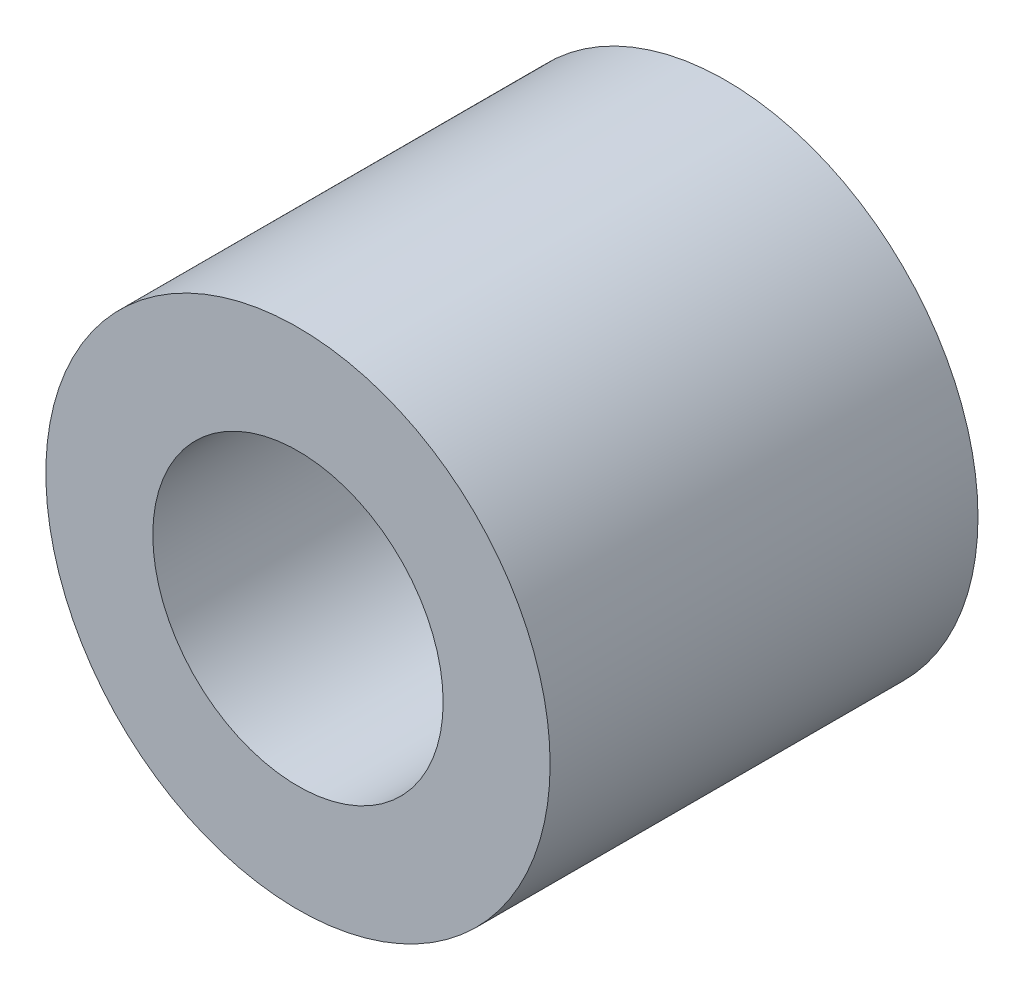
ISO-10303-21;
HEADER;
FILE_DESCRIPTION(('STEP AP214'),'2;1');
FILE_NAME('part.step','',(''),(''),'','','');
FILE_SCHEMA(('AUTOMOTIVE_DESIGN { 1 0 10303 214 1 1 1 1 }'));
ENDSEC;
DATA;
#1=APPLICATION_CONTEXT('core data for automotive mechanical design processes');
#2=APPLICATION_PROTOCOL_DEFINITION('international standard','automotive_design',2000,#1);
#3=PRODUCT_CONTEXT('',#1,'mechanical');
#4=PRODUCT('Part','Part','',(#3));
#5=PRODUCT_RELATED_PRODUCT_CATEGORY('part','',(#4));
#6=PRODUCT_DEFINITION_FORMATION('','',#4);
#7=PRODUCT_DEFINITION_CONTEXT('part definition',#1,'design');
#8=PRODUCT_DEFINITION('design','',#6,#7);
#9=PRODUCT_DEFINITION_SHAPE('','',#8);
#10=(LENGTH_UNIT() NAMED_UNIT(*) SI_UNIT(.MILLI.,.METRE.));
#11=(NAMED_UNIT(*) PLANE_ANGLE_UNIT() SI_UNIT($,.RADIAN.));
#12=(NAMED_UNIT(*) SI_UNIT($,.STERADIAN.) SOLID_ANGLE_UNIT());
#13=UNCERTAINTY_MEASURE_WITH_UNIT(LENGTH_MEASURE(1.E-05),#10,'distance_accuracy_value','');
#14=(GEOMETRIC_REPRESENTATION_CONTEXT(3) GLOBAL_UNCERTAINTY_ASSIGNED_CONTEXT((#13)) GLOBAL_UNIT_ASSIGNED_CONTEXT((#10,
#11,#12)) REPRESENTATION_CONTEXT('',''));
#15=CARTESIAN_POINT('',(0.,0.,0.));
#16=DIRECTION('',(0.,0.,1.));
#17=DIRECTION('',(1.,0.,0.));
#18=AXIS2_PLACEMENT_3D('',#15,#16,#17);
#19=CARTESIAN_POINT('',(0.,1.65,1.4));
#20=DIRECTION('',(0.,0.,-1.));
#21=DIRECTION('',(-1.,0.,0.));
#22=AXIS2_PLACEMENT_3D('',#19,#20,#21);
#23=PLANE('',#22);
#24=CARTESIAN_POINT('',(0.,0.,1.4));
#25=DIRECTION('',(0.,0.,1.));
#26=DIRECTION('',(1.,0.,0.));
#27=AXIS2_PLACEMENT_3D('',#24,#25,#26);
#28=CIRCLE('',#27,0.95);
#29=CARTESIAN_POINT('',(0.95,0.,1.4));
#30=VERTEX_POINT('',#29);
#31=EDGE_CURVE('E10',#30,#30,#28,.T.);
#32=ORIENTED_EDGE('',*,*,#31,.F.);
#33=EDGE_LOOP('',(#32));
#34=FACE_BOUND('',#33,.T.);
#35=CARTESIAN_POINT('',(0.,0.,1.4));
#36=DIRECTION('',(0.,0.,1.));
#37=DIRECTION('',(1.,0.,0.));
#38=AXIS2_PLACEMENT_3D('',#35,#36,#37);
#39=CIRCLE('',#38,1.65);
#40=CARTESIAN_POINT('',(1.65,0.,1.4));
#41=VERTEX_POINT('',#40);
#42=EDGE_CURVE('E41',#41,#41,#39,.T.);
#43=ORIENTED_EDGE('',*,*,#42,.T.);
#44=EDGE_LOOP('',(#43));
#45=FACE_BOUND('',#44,.T.);
#46=ADVANCED_FACE('F27',(#34,#45),#23,.F.);
#47=CARTESIAN_POINT('',(0.,0.,6.5));
#48=DIRECTION('',(0.,0.,1.));
#49=DIRECTION('',(1.,0.,0.));
#50=AXIS2_PLACEMENT_3D('',#47,#48,#49);
#51=CYLINDRICAL_SURFACE('',#50,0.95);
#52=CARTESIAN_POINT('',(0.,0.,-1.4));
#53=DIRECTION('',(0.,0.,1.));
#54=DIRECTION('',(1.,0.,0.));
#55=AXIS2_PLACEMENT_3D('',#52,#53,#54);
#56=CIRCLE('',#55,0.95);
#57=CARTESIAN_POINT('',(0.95,0.,-1.4));
#58=VERTEX_POINT('',#57);
#59=EDGE_CURVE('E33',#58,#58,#56,.T.);
#60=ORIENTED_EDGE('',*,*,#59,.F.);
#61=EDGE_LOOP('',(#60));
#62=FACE_BOUND('',#61,.T.);
#63=ORIENTED_EDGE('',*,*,#31,.T.);
#64=EDGE_LOOP('',(#63));
#65=FACE_BOUND('',#64,.T.);
#66=ADVANCED_FACE('F56',(#62,#65),#51,.F.);
#67=CARTESIAN_POINT('',(0.,1.65,-1.4));
#68=DIRECTION('',(0.,0.,1.));
#69=DIRECTION('',(1.,0.,0.));
#70=AXIS2_PLACEMENT_3D('',#67,#68,#69);
#71=PLANE('',#70);
#72=CARTESIAN_POINT('',(0.,0.,-1.4));
#73=DIRECTION('',(0.,0.,1.));
#74=DIRECTION('',(1.,0.,0.));
#75=AXIS2_PLACEMENT_3D('',#72,#73,#74);
#76=CIRCLE('',#75,1.65);
#77=CARTESIAN_POINT('',(1.65,0.,-1.4));
#78=VERTEX_POINT('',#77);
#79=EDGE_CURVE('E37',#78,#78,#76,.T.);
#80=ORIENTED_EDGE('',*,*,#79,.F.);
#81=EDGE_LOOP('',(#80));
#82=FACE_BOUND('',#81,.T.);
#83=ORIENTED_EDGE('',*,*,#59,.T.);
#84=EDGE_LOOP('',(#83));
#85=FACE_BOUND('',#84,.T.);
#86=ADVANCED_FACE('F51',(#82,#85),#71,.F.);
#87=CARTESIAN_POINT('',(0.,0.,6.5));
#88=DIRECTION('',(0.,0.,1.));
#89=DIRECTION('',(1.,0.,0.));
#90=AXIS2_PLACEMENT_3D('',#87,#88,#89);
#91=CYLINDRICAL_SURFACE('',#90,1.65);
#92=ORIENTED_EDGE('',*,*,#42,.F.);
#93=EDGE_LOOP('',(#92));
#94=FACE_BOUND('',#93,.T.);
#95=ORIENTED_EDGE('',*,*,#79,.T.);
#96=EDGE_LOOP('',(#95));
#97=FACE_BOUND('',#96,.T.);
#98=ADVANCED_FACE('F48',(#94,#97),#91,.T.);
#99=CLOSED_SHELL('',(#46,#66,#86,#98));
#100=MANIFOLD_SOLID_BREP('B2',#99);
#101=ADVANCED_BREP_SHAPE_REPRESENTATION('',(#18,#100),#14);
#102=SHAPE_DEFINITION_REPRESENTATION(#9,#101);
ENDSEC;
END-ISO-10303-21;
